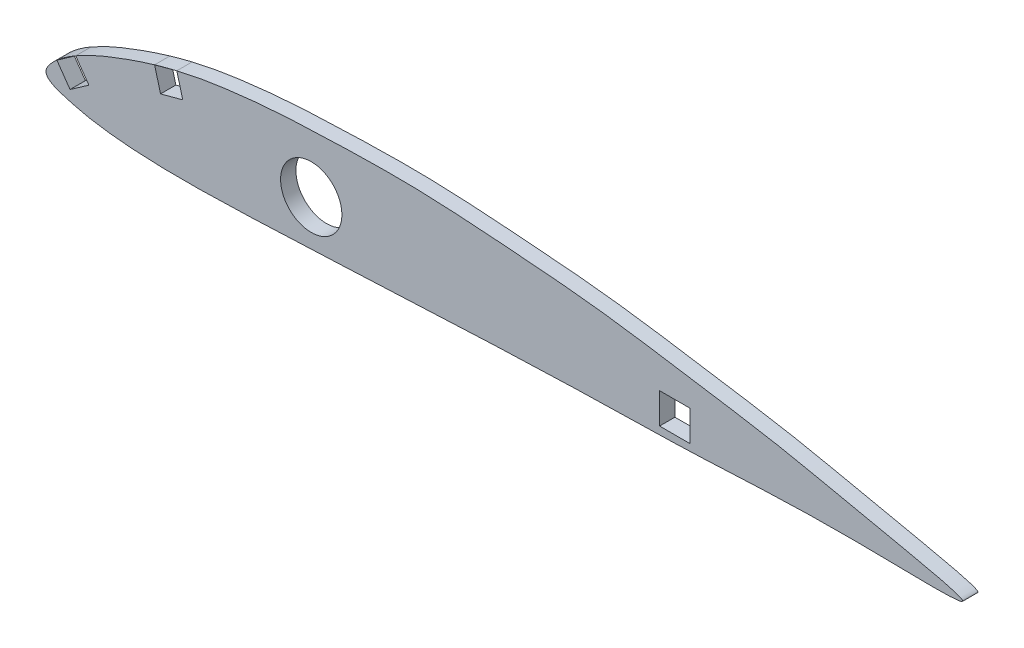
ISO-10303-21;
HEADER;
FILE_DESCRIPTION(('STEP AP214'),'2;1');
FILE_NAME('part.step','',(''),(''),'','','');
FILE_SCHEMA(('AUTOMOTIVE_DESIGN { 1 0 10303 214 1 1 1 1 }'));
ENDSEC;
DATA;
#1=APPLICATION_CONTEXT('core data for automotive mechanical design processes');
#2=APPLICATION_PROTOCOL_DEFINITION('international standard','automotive_design',2000,#1);
#3=PRODUCT_CONTEXT('',#1,'mechanical');
#4=PRODUCT('Part','Part','',(#3));
#5=PRODUCT_RELATED_PRODUCT_CATEGORY('part','',(#4));
#6=PRODUCT_DEFINITION_FORMATION('','',#4);
#7=PRODUCT_DEFINITION_CONTEXT('part definition',#1,'design');
#8=PRODUCT_DEFINITION('design','',#6,#7);
#9=PRODUCT_DEFINITION_SHAPE('','',#8);
#10=(LENGTH_UNIT() NAMED_UNIT(*) SI_UNIT(.MILLI.,.METRE.));
#11=(NAMED_UNIT(*) PLANE_ANGLE_UNIT() SI_UNIT($,.RADIAN.));
#12=(NAMED_UNIT(*) SI_UNIT($,.STERADIAN.) SOLID_ANGLE_UNIT());
#13=UNCERTAINTY_MEASURE_WITH_UNIT(LENGTH_MEASURE(1.E-05),#10,'distance_accuracy_value','');
#14=(GEOMETRIC_REPRESENTATION_CONTEXT(3) GLOBAL_UNCERTAINTY_ASSIGNED_CONTEXT((#13)) GLOBAL_UNIT_ASSIGNED_CONTEXT((#10,
#11,#12)) REPRESENTATION_CONTEXT('',''));
#15=CARTESIAN_POINT('',(0.,0.,0.));
#16=DIRECTION('',(0.,0.,1.));
#17=DIRECTION('',(1.,0.,0.));
#18=AXIS2_PLACEMENT_3D('',#15,#16,#17);
#19=CARTESIAN_POINT('',(0.,0.,0.));
#20=DIRECTION('',(0.,0.,-1.));
#21=DIRECTION('',(-1.,0.,0.));
#22=AXIS2_PLACEMENT_3D('',#19,#20,#21);
#23=PLANE('',#22);
#24=DIRECTION('',(0.,1.,0.));
#25=VECTOR('',#24,1.);
#26=CARTESIAN_POINT('',(127.097,0.,0.));
#27=LINE('',#26,#25);
#28=CARTESIAN_POINT('',(127.097,0.,0.));
#29=VERTEX_POINT('',#28);
#30=CARTESIAN_POINT('',(127.097,6.35,0.));
#31=VERTEX_POINT('',#30);
#32=EDGE_CURVE('E195',#29,#31,#27,.T.);
#33=ORIENTED_EDGE('',*,*,#32,.F.);
#34=DIRECTION('',(-1.,0.,0.));
#35=VECTOR('',#34,1.);
#36=CARTESIAN_POINT('',(0.,0.,0.));
#37=LINE('',#36,#35);
#38=CARTESIAN_POINT('',(133.447,0.,0.));
#39=VERTEX_POINT('',#38);
#40=EDGE_CURVE('E143',#39,#29,#37,.T.);
#41=ORIENTED_EDGE('',*,*,#40,.F.);
#42=DIRECTION('',(0.,-1.,0.));
#43=VECTOR('',#42,1.);
#44=CARTESIAN_POINT('',(133.447,0.,0.));
#45=LINE('',#44,#43);
#46=CARTESIAN_POINT('',(133.447,6.35,0.));
#47=VERTEX_POINT('',#46);
#48=EDGE_CURVE('E131',#47,#39,#45,.T.);
#49=ORIENTED_EDGE('',*,*,#48,.F.);
#50=DIRECTION('',(1.,0.,0.));
#51=VECTOR('',#50,1.);
#52=CARTESIAN_POINT('',(0.,6.35,0.));
#53=LINE('',#52,#51);
#54=EDGE_CURVE('E151',#31,#47,#53,.T.);
#55=ORIENTED_EDGE('',*,*,#54,.F.);
#56=EDGE_LOOP('',(#33,#41,#49,#55));
#57=FACE_BOUND('',#56,.T.);
#58=DIRECTION('',(-0.573576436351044,0.819152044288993,0.));
#59=VECTOR('',#58,1.);
#60=CARTESIAN_POINT('',(3.0212446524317,2.11549828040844,0.));
#61=LINE('',#60,#59);
#62=CARTESIAN_POINT('',(4.98235798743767,-0.685261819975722,0.));
#63=VERTEX_POINT('',#62);
#64=CARTESIAN_POINT('',(2.25070020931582,3.21594979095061,0.));
#65=VERTEX_POINT('',#64);
#66=EDGE_CURVE('E157',#63,#65,#61,.T.);
#67=ORIENTED_EDGE('',*,*,#66,.F.);
#68=DIRECTION('',(-0.819152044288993,-0.573576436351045,0.));
#69=VECTOR('',#68,1.);
#70=CARTESIAN_POINT('',(1.96111333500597,-2.80076010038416,0.));
#71=LINE('',#70,#69);
#72=CARTESIAN_POINT('',(8.883569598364,2.04639595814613,0.));
#73=VERTEX_POINT('',#72);
#74=EDGE_CURVE('E214',#73,#63,#71,.T.);
#75=ORIENTED_EDGE('',*,*,#74,.F.);
#76=DIRECTION('',(0.573576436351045,-0.819152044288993,0.));
#77=VECTOR('',#76,1.);
#78=CARTESIAN_POINT('',(6.92245626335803,4.8471560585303,0.));
#79=LINE('',#78,#77);
#80=CARTESIAN_POINT('',(6.15191182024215,5.94760756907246,0.));
#81=VERTEX_POINT('',#80);
#82=EDGE_CURVE('E224',#81,#73,#79,.T.);
#83=ORIENTED_EDGE('',*,*,#82,.F.);
#84=CARTESIAN_POINT('',(0.,0.,0.));
#85=CARTESIAN_POINT('',(-0.052312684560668,1.01588552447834,0.));
#86=CARTESIAN_POINT('',(2.16598697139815,3.29635815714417,0.));
#87=CARTESIAN_POINT('',(5.31665733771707,5.55289262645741,0.));
#88=CARTESIAN_POINT('',(9.40016071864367,7.75182181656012,0.));
#89=CARTESIAN_POINT('',(17.2202194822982,10.9327993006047,0.));
#90=CARTESIAN_POINT('',(26.7064135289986,13.9594122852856,0.));
#91=CARTESIAN_POINT('',(37.9353835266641,15.7551230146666,0.));
#92=CARTESIAN_POINT('',(47.452587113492,16.7049080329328,0.));
#93=CARTESIAN_POINT('',(60.1209164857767,17.2358385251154,0.));
#94=CARTESIAN_POINT('',(75.972266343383,17.6854280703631,0.));
#95=CARTESIAN_POINT('',(94.9440869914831,16.3539049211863,0.));
#96=CARTESIAN_POINT('',(114.052882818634,14.8649493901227,0.));
#97=CARTESIAN_POINT('',(132.728084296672,11.8733247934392,0.));
#98=CARTESIAN_POINT('',(152.761524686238,8.81070256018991,0.));
#99=CARTESIAN_POINT('',(168.050310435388,5.21393768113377,0.));
#100=CARTESIAN_POINT('',(200.59520382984,-1.23261563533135,0.));
#101=CARTESIAN_POINT('',(158.485441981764,0.250590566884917,0.));
#102=CARTESIAN_POINT('',(140.172902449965,-1.42529799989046,0.));
#103=CARTESIAN_POINT('',(100.64106675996,-2.04847327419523,0.));
#104=CARTESIAN_POINT('',(69.7391640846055,-3.73228321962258,0.));
#105=CARTESIAN_POINT('',(37.922908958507,-5.11912377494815,0.));
#106=CARTESIAN_POINT('',(22.2869194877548,-5.37550998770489,0.));
#107=CARTESIAN_POINT('',(10.7780722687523,-4.26084328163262,0.));
#108=CARTESIAN_POINT('',(4.91909071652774,-2.92119132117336,0.));
#109=CARTESIAN_POINT('',(0.0717865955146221,-1.39405889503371,0.));
#110=CARTESIAN_POINT('',(0.,0.,0.));
#111=B_SPLINE_CURVE_WITH_KNOTS('',3,(#84,#85,#86,#87,#88,#89,#90,#91,#92,#93,#94,#95,#96,#97,
#98,#99,#100,#101,#102,#103,#104,#105,#106,#107,#108,#109,#110),.UNSPECIFIED.,.T.,.F.,(4,1,1,1,
1,1,1,1,1,1,1,1,1,1,1,1,1,1,1,1,1,1,1,1,4),(0.,0.0105604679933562,0.0182111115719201,
0.0322098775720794,0.0455249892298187,0.0840694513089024,0.10897429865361,0.133649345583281,
0.158232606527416,0.207343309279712,0.25652270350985,0.30582635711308,0.355445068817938,
0.40521420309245,0.4553904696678,0.506006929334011,0.555121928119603,0.653369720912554,
0.702490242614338,0.849938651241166,0.899083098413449,0.948194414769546,0.972905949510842,
0.985508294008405,1.),.UNSPECIFIED.);
#112=CARTESIAN_POINT('',(22.4932353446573,12.498714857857,0.));
#113=VERTEX_POINT('',#112);
#114=EDGE_CURVE('E170',#81,#113,#111,.T.);
#115=ORIENTED_EDGE('',*,*,#114,.T.);
#116=DIRECTION('',(-0.258819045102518,0.965925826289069,0.));
#117=VECTOR('',#116,1.);
#118=CARTESIAN_POINT('',(24.1111529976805,6.46056397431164,0.));
#119=LINE('',#118,#117);
#120=CARTESIAN_POINT('',(23.725861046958,7.89849311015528,0.));
#121=VERTEX_POINT('',#120);
#122=EDGE_CURVE('E206',#121,#113,#119,.T.);
#123=ORIENTED_EDGE('',*,*,#122,.F.);
#124=DIRECTION('',(-0.965925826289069,-0.258819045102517,0.));
#125=VECTOR('',#124,1.);
#126=CARTESIAN_POINT('',(-0.385291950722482,1.43792913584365,0.));
#127=LINE('',#126,#125);
#128=CARTESIAN_POINT('',(28.3260827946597,9.13111881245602,0.));
#129=VERTEX_POINT('',#128);
#130=EDGE_CURVE('E218',#129,#121,#127,.T.);
#131=ORIENTED_EDGE('',*,*,#130,.F.);
#132=DIRECTION('',(0.258819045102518,-0.965925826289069,0.));
#133=VECTOR('',#132,1.);
#134=CARTESIAN_POINT('',(28.7113747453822,7.6931896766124,0.));
#135=LINE('',#134,#133);
#136=CARTESIAN_POINT('',(27.093457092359,13.7313405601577,0.));
#137=VERTEX_POINT('',#136);
#138=EDGE_CURVE('E228',#137,#129,#135,.T.);
#139=ORIENTED_EDGE('',*,*,#138,.F.);
#140=EDGE_CURVE('E163',#137,#65,#111,.T.);
#141=ORIENTED_EDGE('',*,*,#140,.T.);
#142=EDGE_LOOP('',(#67,#75,#83,#115,#123,#131,#139,#141));
#143=FACE_BOUND('',#142,.T.);
#144=CARTESIAN_POINT('',(54.94,5.,0.));
#145=DIRECTION('',(0.,0.,-1.));
#146=DIRECTION('',(-1.,0.,0.));
#147=AXIS2_PLACEMENT_3D('',#144,#145,#146);
#148=CIRCLE('',#147,6.35);
#149=CARTESIAN_POINT('',(48.59,5.,0.));
#150=VERTEX_POINT('',#149);
#151=EDGE_CURVE('E201',#150,#150,#148,.T.);
#152=ORIENTED_EDGE('',*,*,#151,.F.);
#153=EDGE_LOOP('',(#152));
#154=FACE_BOUND('',#153,.T.);
#155=ADVANCED_FACE('F44',(#57,#143,#154),#23,.T.);
#156=CARTESIAN_POINT('',(0.,0.,3.175));
#157=DIRECTION('',(0.,0.,-1.));
#158=DIRECTION('',(-1.,0.,0.));
#159=AXIS2_PLACEMENT_3D('',#156,#157,#158);
#160=PLANE('',#159);
#161=DIRECTION('',(1.,0.,0.));
#162=VECTOR('',#161,1.);
#163=CARTESIAN_POINT('',(127.097,0.,3.175));
#164=LINE('',#163,#162);
#165=CARTESIAN_POINT('',(127.097,0.,3.175));
#166=VERTEX_POINT('',#165);
#167=CARTESIAN_POINT('',(133.447,0.,3.175));
#168=VERTEX_POINT('',#167);
#169=EDGE_CURVE('E13',#166,#168,#164,.T.);
#170=ORIENTED_EDGE('',*,*,#169,.F.);
#171=DIRECTION('',(0.,-1.,0.));
#172=VECTOR('',#171,1.);
#173=CARTESIAN_POINT('',(127.097,6.35,3.175));
#174=LINE('',#173,#172);
#175=CARTESIAN_POINT('',(127.097,6.35,3.175));
#176=VERTEX_POINT('',#175);
#177=EDGE_CURVE('E149',#176,#166,#174,.T.);
#178=ORIENTED_EDGE('',*,*,#177,.F.);
#179=DIRECTION('',(-1.,0.,0.));
#180=VECTOR('',#179,1.);
#181=CARTESIAN_POINT('',(127.097,6.35,3.175));
#182=LINE('',#181,#180);
#183=CARTESIAN_POINT('',(133.447,6.35,3.175));
#184=VERTEX_POINT('',#183);
#185=EDGE_CURVE('E142',#184,#176,#182,.T.);
#186=ORIENTED_EDGE('',*,*,#185,.F.);
#187=DIRECTION('',(0.,1.,0.));
#188=VECTOR('',#187,1.);
#189=CARTESIAN_POINT('',(133.447,6.35,3.175));
#190=LINE('',#189,#188);
#191=EDGE_CURVE('E128',#168,#184,#190,.T.);
#192=ORIENTED_EDGE('',*,*,#191,.F.);
#193=EDGE_LOOP('',(#170,#178,#186,#192));
#194=FACE_BOUND('',#193,.T.);
#195=CARTESIAN_POINT('',(54.94,5.,3.175));
#196=DIRECTION('',(0.,0.,1.));
#197=DIRECTION('',(1.,0.,0.));
#198=AXIS2_PLACEMENT_3D('',#195,#196,#197);
#199=CIRCLE('',#198,6.35);
#200=CARTESIAN_POINT('',(61.29,5.,3.175));
#201=VERTEX_POINT('',#200);
#202=EDGE_CURVE('E203',#201,#201,#199,.T.);
#203=ORIENTED_EDGE('',*,*,#202,.F.);
#204=EDGE_LOOP('',(#203));
#205=FACE_BOUND('',#204,.T.);
#206=DIRECTION('',(0.819152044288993,0.573576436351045,0.));
#207=VECTOR('',#206,1.);
#208=CARTESIAN_POINT('',(4.98235798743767,-0.685261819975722,3.175));
#209=LINE('',#208,#207);
#210=CARTESIAN_POINT('',(4.98235798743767,-0.685261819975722,3.175));
#211=VERTEX_POINT('',#210);
#212=CARTESIAN_POINT('',(8.883569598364,2.04639595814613,3.175));
#213=VERTEX_POINT('',#212);
#214=EDGE_CURVE('E211',#211,#213,#209,.T.);
#215=ORIENTED_EDGE('',*,*,#214,.F.);
#216=DIRECTION('',(0.573576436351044,-0.819152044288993,0.));
#217=VECTOR('',#216,1.);
#218=CARTESIAN_POINT('',(2.25070020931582,3.21594979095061,3.175));
#219=LINE('',#218,#217);
#220=CARTESIAN_POINT('',(2.25070020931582,3.21594979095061,3.175));
#221=VERTEX_POINT('',#220);
#222=EDGE_CURVE('E156',#221,#211,#219,.T.);
#223=ORIENTED_EDGE('',*,*,#222,.F.);
#224=CARTESIAN_POINT('',(0.,0.,3.175));
#225=CARTESIAN_POINT('',(-0.052312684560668,1.01588552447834,3.175));
#226=CARTESIAN_POINT('',(2.16598697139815,3.29635815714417,3.175));
#227=CARTESIAN_POINT('',(5.31665733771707,5.55289262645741,3.175));
#228=CARTESIAN_POINT('',(9.40016071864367,7.75182181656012,3.175));
#229=CARTESIAN_POINT('',(17.2202194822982,10.9327993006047,3.175));
#230=CARTESIAN_POINT('',(26.7064135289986,13.9594122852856,3.175));
#231=CARTESIAN_POINT('',(37.9353835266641,15.7551230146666,3.175));
#232=CARTESIAN_POINT('',(47.452587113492,16.7049080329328,3.175));
#233=CARTESIAN_POINT('',(60.1209164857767,17.2358385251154,3.175));
#234=CARTESIAN_POINT('',(75.972266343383,17.6854280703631,3.175));
#235=CARTESIAN_POINT('',(94.9440869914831,16.3539049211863,3.175));
#236=CARTESIAN_POINT('',(114.052882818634,14.8649493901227,3.175));
#237=CARTESIAN_POINT('',(132.728084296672,11.8733247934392,3.175));
#238=CARTESIAN_POINT('',(152.761524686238,8.81070256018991,3.175));
#239=CARTESIAN_POINT('',(168.050310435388,5.21393768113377,3.175));
#240=CARTESIAN_POINT('',(200.59520382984,-1.23261563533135,3.175));
#241=CARTESIAN_POINT('',(158.485441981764,0.250590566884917,3.175));
#242=CARTESIAN_POINT('',(140.172902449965,-1.42529799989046,3.175));
#243=CARTESIAN_POINT('',(100.64106675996,-2.04847327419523,3.175));
#244=CARTESIAN_POINT('',(69.7391640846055,-3.73228321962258,3.175));
#245=CARTESIAN_POINT('',(37.922908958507,-5.11912377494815,3.175));
#246=CARTESIAN_POINT('',(22.2869194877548,-5.37550998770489,3.175));
#247=CARTESIAN_POINT('',(10.7780722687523,-4.26084328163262,3.175));
#248=CARTESIAN_POINT('',(4.91909071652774,-2.92119132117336,3.175));
#249=CARTESIAN_POINT('',(0.0717865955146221,-1.39405889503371,3.175));
#250=CARTESIAN_POINT('',(0.,0.,3.175));
#251=B_SPLINE_CURVE_WITH_KNOTS('',3,(#224,#225,#226,#227,#228,#229,#230,#231,#232,#233,#234,
#235,#236,#237,#238,#239,#240,#241,#242,#243,#244,#245,#246,#247,#248,#249,#250),.UNSPECIFIED.,
.T.,.F.,(4,1,1,1,1,1,1,1,1,1,1,1,1,1,1,1,1,1,1,1,1,1,1,1,4),(0.,0.0105604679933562,
0.0182111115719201,0.0322098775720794,0.0455249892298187,0.0840694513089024,0.10897429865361,
0.133649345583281,0.158232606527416,0.207343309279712,0.25652270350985,0.30582635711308,
0.355445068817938,0.40521420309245,0.4553904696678,0.506006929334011,0.555121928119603,
0.653369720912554,0.702490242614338,0.849938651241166,0.899083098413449,0.948194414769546,
0.972905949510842,0.985508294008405,1.),.UNSPECIFIED.);
#252=CARTESIAN_POINT('',(27.0934570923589,13.7313405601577,3.175));
#253=VERTEX_POINT('',#252);
#254=EDGE_CURVE('E162',#253,#221,#251,.T.);
#255=ORIENTED_EDGE('',*,*,#254,.F.);
#256=DIRECTION('',(-0.258819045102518,0.965925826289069,0.));
#257=VECTOR('',#256,1.);
#258=CARTESIAN_POINT('',(27.093457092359,13.7313405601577,3.175));
#259=LINE('',#258,#257);
#260=CARTESIAN_POINT('',(28.3260827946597,9.13111881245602,3.175));
#261=VERTEX_POINT('',#260);
#262=EDGE_CURVE('E221',#261,#253,#259,.T.);
#263=ORIENTED_EDGE('',*,*,#262,.F.);
#264=DIRECTION('',(0.965925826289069,0.258819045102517,0.));
#265=VECTOR('',#264,1.);
#266=CARTESIAN_POINT('',(23.725861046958,7.89849311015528,3.175));
#267=LINE('',#266,#265);
#268=CARTESIAN_POINT('',(23.725861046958,7.89849311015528,3.175));
#269=VERTEX_POINT('',#268);
#270=EDGE_CURVE('E223',#269,#261,#267,.T.);
#271=ORIENTED_EDGE('',*,*,#270,.F.);
#272=DIRECTION('',(0.258819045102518,-0.965925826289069,0.));
#273=VECTOR('',#272,1.);
#274=CARTESIAN_POINT('',(22.4932353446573,12.498714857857,3.175));
#275=LINE('',#274,#273);
#276=CARTESIAN_POINT('',(22.4932353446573,12.498714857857,3.175));
#277=VERTEX_POINT('',#276);
#278=EDGE_CURVE('E231',#277,#269,#275,.T.);
#279=ORIENTED_EDGE('',*,*,#278,.F.);
#280=CARTESIAN_POINT('',(6.15191183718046,5.94760757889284,3.175));
#281=VERTEX_POINT('',#280);
#282=EDGE_CURVE('E161',#281,#277,#251,.T.);
#283=ORIENTED_EDGE('',*,*,#282,.F.);
#284=DIRECTION('',(-0.573576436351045,0.819152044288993,0.));
#285=VECTOR('',#284,1.);
#286=CARTESIAN_POINT('',(6.15191182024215,5.94760756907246,3.175));
#287=LINE('',#286,#285);
#288=EDGE_CURVE('E217',#213,#281,#287,.T.);
#289=ORIENTED_EDGE('',*,*,#288,.F.);
#290=EDGE_LOOP('',(#215,#223,#255,#263,#271,#279,#283,#289));
#291=FACE_BOUND('',#290,.T.);
#292=ADVANCED_FACE('F140',(#194,#205,#291),#160,.F.);
#293=DIRECTION('',(0.,0.,1.));
#294=VECTOR('',#293,1.);
#295=SURFACE_OF_LINEAR_EXTRUSION('',#111,#294);
#296=DIRECTION('',(0.,0.,1.));
#297=VECTOR('',#296,1.);
#298=CARTESIAN_POINT('',(2.25070020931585,3.21594979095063,0.));
#299=LINE('',#298,#297);
#300=EDGE_CURVE('E153',#65,#221,#299,.T.);
#301=ORIENTED_EDGE('',*,*,#300,.F.);
#302=ORIENTED_EDGE('',*,*,#140,.F.);
#303=DIRECTION('',(0.,0.,1.));
#304=VECTOR('',#303,1.);
#305=CARTESIAN_POINT('',(27.093457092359,13.7313405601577,0.));
#306=LINE('',#305,#304);
#307=EDGE_CURVE('E169',#137,#253,#306,.T.);
#308=ORIENTED_EDGE('',*,*,#307,.T.);
#309=ORIENTED_EDGE('',*,*,#254,.T.);
#310=EDGE_LOOP('',(#301,#302,#308,#309));
#311=FACE_BOUND('',#310,.T.);
#312=ADVANCED_FACE('F179',(#311),#295,.F.);
#313=ORIENTED_EDGE('',*,*,#114,.F.);
#314=DIRECTION('',(0.,0.,1.));
#315=VECTOR('',#314,1.);
#316=CARTESIAN_POINT('',(6.15191182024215,5.94760756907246,0.));
#317=LINE('',#316,#315);
#318=EDGE_CURVE('E158',#81,#281,#317,.T.);
#319=ORIENTED_EDGE('',*,*,#318,.T.);
#320=ORIENTED_EDGE('',*,*,#282,.T.);
#321=DIRECTION('',(0.,0.,1.));
#322=VECTOR('',#321,1.);
#323=CARTESIAN_POINT('',(22.4932353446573,12.498714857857,0.));
#324=LINE('',#323,#322);
#325=EDGE_CURVE('E47',#113,#277,#324,.T.);
#326=ORIENTED_EDGE('',*,*,#325,.F.);
#327=EDGE_LOOP('',(#313,#319,#320,#326));
#328=FACE_BOUND('',#327,.T.);
#329=ADVANCED_FACE('F175',(#328),#295,.F.);
#330=CARTESIAN_POINT('',(54.94,5.,-6.825));
#331=DIRECTION('',(0.,0.,1.));
#332=DIRECTION('',(1.,0.,0.));
#333=AXIS2_PLACEMENT_3D('',#330,#331,#332);
#334=CYLINDRICAL_SURFACE('',#333,6.35);
#335=ORIENTED_EDGE('',*,*,#151,.T.);
#336=EDGE_LOOP('',(#335));
#337=FACE_BOUND('',#336,.T.);
#338=ORIENTED_EDGE('',*,*,#202,.T.);
#339=EDGE_LOOP('',(#338));
#340=FACE_BOUND('',#339,.T.);
#341=ADVANCED_FACE('F178',(#337,#340),#334,.F.);
#342=CARTESIAN_POINT('',(22.4932353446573,12.498714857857,-6.825));
#343=DIRECTION('',(-0.965925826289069,-0.258819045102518,0.));
#344=DIRECTION('',(0.258819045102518,-0.965925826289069,0.));
#345=AXIS2_PLACEMENT_3D('',#342,#343,#344);
#346=PLANE('',#345);
#347=ORIENTED_EDGE('',*,*,#122,.T.);
#348=ORIENTED_EDGE('',*,*,#325,.T.);
#349=ORIENTED_EDGE('',*,*,#278,.T.);
#350=DIRECTION('',(0.,0.,1.));
#351=VECTOR('',#350,1.);
#352=CARTESIAN_POINT('',(23.725861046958,7.89849311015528,-6.825));
#353=LINE('',#352,#351);
#354=EDGE_CURVE('E220',#121,#269,#353,.T.);
#355=ORIENTED_EDGE('',*,*,#354,.F.);
#356=EDGE_LOOP('',(#347,#348,#349,#355));
#357=FACE_BOUND('',#356,.T.);
#358=ADVANCED_FACE('F324',(#357),#346,.F.);
#359=CARTESIAN_POINT('',(27.093457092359,13.7313405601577,-6.825));
#360=DIRECTION('',(0.965925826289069,0.258819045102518,0.));
#361=DIRECTION('',(-0.258819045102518,0.965925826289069,0.));
#362=AXIS2_PLACEMENT_3D('',#359,#360,#361);
#363=PLANE('',#362);
#364=ORIENTED_EDGE('',*,*,#138,.T.);
#365=DIRECTION('',(0.,0.,1.));
#366=VECTOR('',#365,1.);
#367=CARTESIAN_POINT('',(28.3260827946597,9.13111881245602,-6.825));
#368=LINE('',#367,#366);
#369=EDGE_CURVE('E230',#129,#261,#368,.T.);
#370=ORIENTED_EDGE('',*,*,#369,.T.);
#371=ORIENTED_EDGE('',*,*,#262,.T.);
#372=ORIENTED_EDGE('',*,*,#307,.F.);
#373=EDGE_LOOP('',(#364,#370,#371,#372));
#374=FACE_BOUND('',#373,.T.);
#375=ADVANCED_FACE('F314',(#374),#363,.F.);
#376=CARTESIAN_POINT('',(23.725861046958,7.89849311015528,-6.825));
#377=DIRECTION('',(0.258819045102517,-0.965925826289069,0.));
#378=DIRECTION('',(0.965925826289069,0.258819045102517,0.));
#379=AXIS2_PLACEMENT_3D('',#376,#377,#378);
#380=PLANE('',#379);
#381=ORIENTED_EDGE('',*,*,#130,.T.);
#382=ORIENTED_EDGE('',*,*,#354,.T.);
#383=ORIENTED_EDGE('',*,*,#270,.T.);
#384=ORIENTED_EDGE('',*,*,#369,.F.);
#385=EDGE_LOOP('',(#381,#382,#383,#384));
#386=FACE_BOUND('',#385,.T.);
#387=ADVANCED_FACE('F304',(#386),#380,.F.);
#388=CARTESIAN_POINT('',(2.25070020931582,3.21594979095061,-6.825));
#389=DIRECTION('',(-0.819152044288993,-0.573576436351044,0.));
#390=DIRECTION('',(0.573576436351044,-0.819152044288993,0.));
#391=AXIS2_PLACEMENT_3D('',#388,#389,#390);
#392=PLANE('',#391);
#393=ORIENTED_EDGE('',*,*,#66,.T.);
#394=ORIENTED_EDGE('',*,*,#300,.T.);
#395=ORIENTED_EDGE('',*,*,#222,.T.);
#396=DIRECTION('',(0.,0.,1.));
#397=VECTOR('',#396,1.);
#398=CARTESIAN_POINT('',(4.98235798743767,-0.685261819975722,-6.825));
#399=LINE('',#398,#397);
#400=EDGE_CURVE('E216',#63,#211,#399,.T.);
#401=ORIENTED_EDGE('',*,*,#400,.F.);
#402=EDGE_LOOP('',(#393,#394,#395,#401));
#403=FACE_BOUND('',#402,.T.);
#404=ADVANCED_FACE('F295',(#403),#392,.F.);
#405=CARTESIAN_POINT('',(6.15191182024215,5.94760756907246,-6.825));
#406=DIRECTION('',(0.819152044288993,0.573576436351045,0.));
#407=DIRECTION('',(-0.573576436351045,0.819152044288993,0.));
#408=AXIS2_PLACEMENT_3D('',#405,#406,#407);
#409=PLANE('',#408);
#410=ORIENTED_EDGE('',*,*,#82,.T.);
#411=DIRECTION('',(0.,0.,1.));
#412=VECTOR('',#411,1.);
#413=CARTESIAN_POINT('',(8.883569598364,2.04639595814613,-6.825));
#414=LINE('',#413,#412);
#415=EDGE_CURVE('E226',#73,#213,#414,.T.);
#416=ORIENTED_EDGE('',*,*,#415,.T.);
#417=ORIENTED_EDGE('',*,*,#288,.T.);
#418=ORIENTED_EDGE('',*,*,#318,.F.);
#419=EDGE_LOOP('',(#410,#416,#417,#418));
#420=FACE_BOUND('',#419,.T.);
#421=ADVANCED_FACE('F260',(#420),#409,.F.);
#422=CARTESIAN_POINT('',(4.98235798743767,-0.685261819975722,-6.825));
#423=DIRECTION('',(0.573576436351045,-0.819152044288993,0.));
#424=DIRECTION('',(0.819152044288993,0.573576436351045,0.));
#425=AXIS2_PLACEMENT_3D('',#422,#423,#424);
#426=PLANE('',#425);
#427=ORIENTED_EDGE('',*,*,#74,.T.);
#428=ORIENTED_EDGE('',*,*,#400,.T.);
#429=ORIENTED_EDGE('',*,*,#214,.T.);
#430=ORIENTED_EDGE('',*,*,#415,.F.);
#431=EDGE_LOOP('',(#427,#428,#429,#430));
#432=FACE_BOUND('',#431,.T.);
#433=ADVANCED_FACE('F255',(#432),#426,.F.);
#434=CARTESIAN_POINT('',(127.097,6.35,-6.825));
#435=DIRECTION('',(-1.,0.,0.));
#436=DIRECTION('',(0.,0.,1.));
#437=AXIS2_PLACEMENT_3D('',#434,#435,#436);
#438=PLANE('',#437);
#439=ORIENTED_EDGE('',*,*,#32,.T.);
#440=DIRECTION('',(0.,0.,1.));
#441=VECTOR('',#440,1.);
#442=CARTESIAN_POINT('',(127.097,6.35,-6.825));
#443=LINE('',#442,#441);
#444=EDGE_CURVE('E152',#31,#176,#443,.T.);
#445=ORIENTED_EDGE('',*,*,#444,.T.);
#446=ORIENTED_EDGE('',*,*,#177,.T.);
#447=DIRECTION('',(0.,0.,1.));
#448=VECTOR('',#447,1.);
#449=CARTESIAN_POINT('',(127.097,0.,-6.825));
#450=LINE('',#449,#448);
#451=EDGE_CURVE('E53',#29,#166,#450,.T.);
#452=ORIENTED_EDGE('',*,*,#451,.F.);
#453=EDGE_LOOP('',(#439,#445,#446,#452));
#454=FACE_BOUND('',#453,.T.);
#455=ADVANCED_FACE('F249',(#454),#438,.F.);
#456=CARTESIAN_POINT('',(127.097,6.35,-6.825));
#457=DIRECTION('',(0.,1.,0.));
#458=DIRECTION('',(0.,0.,1.));
#459=AXIS2_PLACEMENT_3D('',#456,#457,#458);
#460=PLANE('',#459);
#461=ORIENTED_EDGE('',*,*,#54,.T.);
#462=DIRECTION('',(0.,0.,1.));
#463=VECTOR('',#462,1.);
#464=CARTESIAN_POINT('',(133.447,6.35,-6.825));
#465=LINE('',#464,#463);
#466=EDGE_CURVE('E123',#47,#184,#465,.T.);
#467=ORIENTED_EDGE('',*,*,#466,.T.);
#468=ORIENTED_EDGE('',*,*,#185,.T.);
#469=ORIENTED_EDGE('',*,*,#444,.F.);
#470=EDGE_LOOP('',(#461,#467,#468,#469));
#471=FACE_BOUND('',#470,.T.);
#472=ADVANCED_FACE('F181',(#471),#460,.F.);
#473=CARTESIAN_POINT('',(133.447,6.35,-6.825));
#474=DIRECTION('',(1.,0.,0.));
#475=DIRECTION('',(0.,0.,-1.));
#476=AXIS2_PLACEMENT_3D('',#473,#474,#475);
#477=PLANE('',#476);
#478=ORIENTED_EDGE('',*,*,#48,.T.);
#479=DIRECTION('',(0.,0.,1.));
#480=VECTOR('',#479,1.);
#481=CARTESIAN_POINT('',(133.447,0.,-6.825));
#482=LINE('',#481,#480);
#483=EDGE_CURVE('E61',#39,#168,#482,.T.);
#484=ORIENTED_EDGE('',*,*,#483,.T.);
#485=ORIENTED_EDGE('',*,*,#191,.T.);
#486=ORIENTED_EDGE('',*,*,#466,.F.);
#487=EDGE_LOOP('',(#478,#484,#485,#486));
#488=FACE_BOUND('',#487,.T.);
#489=ADVANCED_FACE('F126',(#488),#477,.F.);
#490=CARTESIAN_POINT('',(127.097,0.,-6.825));
#491=DIRECTION('',(0.,-1.,0.));
#492=DIRECTION('',(0.,0.,-1.));
#493=AXIS2_PLACEMENT_3D('',#490,#491,#492);
#494=PLANE('',#493);
#495=ORIENTED_EDGE('',*,*,#40,.T.);
#496=ORIENTED_EDGE('',*,*,#451,.T.);
#497=ORIENTED_EDGE('',*,*,#169,.T.);
#498=ORIENTED_EDGE('',*,*,#483,.F.);
#499=EDGE_LOOP('',(#495,#496,#497,#498));
#500=FACE_BOUND('',#499,.T.);
#501=ADVANCED_FACE('F136',(#500),#494,.F.);
#502=CLOSED_SHELL('',(#155,#292,#312,#329,#341,#358,#375,#387,#404,#421,#433,#455,#472,#489,#501));
#503=MANIFOLD_SOLID_BREP('B2',#502);
#504=CARTESIAN_POINT('',(0.,0.,0.));
#505=CARTESIAN_POINT('',(-0.052312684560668,1.01588552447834,0.));
#506=CARTESIAN_POINT('',(2.16598697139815,3.29635815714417,0.));
#507=CARTESIAN_POINT('',(5.31665733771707,5.55289262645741,0.));
#508=CARTESIAN_POINT('',(9.40016071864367,7.75182181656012,0.));
#509=CARTESIAN_POINT('',(17.2202194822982,10.9327993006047,0.));
#510=CARTESIAN_POINT('',(26.7064135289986,13.9594122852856,0.));
#511=CARTESIAN_POINT('',(37.9353835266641,15.7551230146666,0.));
#512=CARTESIAN_POINT('',(47.452587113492,16.7049080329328,0.));
#513=CARTESIAN_POINT('',(60.1209164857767,17.2358385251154,0.));
#514=CARTESIAN_POINT('',(75.972266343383,17.6854280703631,0.));
#515=CARTESIAN_POINT('',(94.9440869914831,16.3539049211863,0.));
#516=CARTESIAN_POINT('',(114.052882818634,14.8649493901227,0.));
#517=CARTESIAN_POINT('',(132.728084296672,11.8733247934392,0.));
#518=CARTESIAN_POINT('',(152.761524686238,8.81070256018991,0.));
#519=CARTESIAN_POINT('',(168.050310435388,5.21393768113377,0.));
#520=CARTESIAN_POINT('',(200.59520382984,-1.23261563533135,0.));
#521=CARTESIAN_POINT('',(158.485441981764,0.250590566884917,0.));
#522=CARTESIAN_POINT('',(140.172902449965,-1.42529799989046,0.));
#523=CARTESIAN_POINT('',(100.64106675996,-2.04847327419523,0.));
#524=CARTESIAN_POINT('',(69.7391640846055,-3.73228321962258,0.));
#525=CARTESIAN_POINT('',(37.922908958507,-5.11912377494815,0.));
#526=CARTESIAN_POINT('',(22.2869194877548,-5.37550998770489,0.));
#527=CARTESIAN_POINT('',(10.7780722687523,-4.26084328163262,0.));
#528=CARTESIAN_POINT('',(4.91909071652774,-2.92119132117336,0.));
#529=CARTESIAN_POINT('',(0.0717865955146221,-1.39405889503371,0.));
#530=CARTESIAN_POINT('',(0.,0.,0.));
#531=B_SPLINE_CURVE_WITH_KNOTS('',3,(#504,#505,#506,#507,#508,#509,#510,#511,#512,#513,#514,
#515,#516,#517,#518,#519,#520,#521,#522,#523,#524,#525,#526,#527,#528,#529,#530),.UNSPECIFIED.,
.T.,.F.,(4,1,1,1,1,1,1,1,1,1,1,1,1,1,1,1,1,1,1,1,1,1,1,1,4),(0.,0.0105604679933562,
0.0182111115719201,0.0322098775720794,0.0455249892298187,0.0840694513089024,0.10897429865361,
0.133649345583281,0.158232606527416,0.207343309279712,0.25652270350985,0.30582635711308,
0.355445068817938,0.40521420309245,0.4553904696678,0.506006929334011,0.555121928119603,
0.653369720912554,0.702490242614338,0.849938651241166,0.899083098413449,0.948194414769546,
0.972905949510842,0.985508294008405,1.),.UNSPECIFIED.);
#532=DIRECTION('',(0.,0.,1.));
#533=VECTOR('',#532,1.);
#534=SURFACE_OF_LINEAR_EXTRUSION('',#531,#533);
#535=CARTESIAN_POINT('',(22.4932353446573,12.498714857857,0.));
#536=VERTEX_POINT('',#535);
#537=CARTESIAN_POINT('',(27.093457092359,13.7313405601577,0.));
#538=VERTEX_POINT('',#537);
#539=EDGE_CURVE('E447',#536,#538,#531,.T.);
#540=ORIENTED_EDGE('',*,*,#539,.F.);
#541=DIRECTION('',(0.,0.,1.));
#542=VECTOR('',#541,1.);
#543=CARTESIAN_POINT('',(22.4932353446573,12.498714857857,0.));
#544=LINE('',#543,#542);
#545=CARTESIAN_POINT('',(22.4932353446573,12.498714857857,3.175));
#546=VERTEX_POINT('',#545);
#547=EDGE_CURVE('E434',#536,#546,#544,.T.);
#548=ORIENTED_EDGE('',*,*,#547,.T.);
#549=CARTESIAN_POINT('',(0.,0.,3.175));
#550=CARTESIAN_POINT('',(-0.052312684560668,1.01588552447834,3.175));
#551=CARTESIAN_POINT('',(2.16598697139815,3.29635815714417,3.175));
#552=CARTESIAN_POINT('',(5.31665733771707,5.55289262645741,3.175));
#553=CARTESIAN_POINT('',(9.40016071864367,7.75182181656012,3.175));
#554=CARTESIAN_POINT('',(17.2202194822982,10.9327993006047,3.175));
#555=CARTESIAN_POINT('',(26.7064135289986,13.9594122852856,3.175));
#556=CARTESIAN_POINT('',(37.9353835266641,15.7551230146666,3.175));
#557=CARTESIAN_POINT('',(47.452587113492,16.7049080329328,3.175));
#558=CARTESIAN_POINT('',(60.1209164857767,17.2358385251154,3.175));
#559=CARTESIAN_POINT('',(75.972266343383,17.6854280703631,3.175));
#560=CARTESIAN_POINT('',(94.9440869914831,16.3539049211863,3.175));
#561=CARTESIAN_POINT('',(114.052882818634,14.8649493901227,3.175));
#562=CARTESIAN_POINT('',(132.728084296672,11.8733247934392,3.175));
#563=CARTESIAN_POINT('',(152.761524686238,8.81070256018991,3.175));
#564=CARTESIAN_POINT('',(168.050310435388,5.21393768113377,3.175));
#565=CARTESIAN_POINT('',(200.59520382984,-1.23261563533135,3.175));
#566=CARTESIAN_POINT('',(158.485441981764,0.250590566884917,3.175));
#567=CARTESIAN_POINT('',(140.172902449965,-1.42529799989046,3.175));
#568=CARTESIAN_POINT('',(100.64106675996,-2.04847327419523,3.175));
#569=CARTESIAN_POINT('',(69.7391640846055,-3.73228321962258,3.175));
#570=CARTESIAN_POINT('',(37.922908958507,-5.11912377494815,3.175));
#571=CARTESIAN_POINT('',(22.2869194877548,-5.37550998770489,3.175));
#572=CARTESIAN_POINT('',(10.7780722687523,-4.26084328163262,3.175));
#573=CARTESIAN_POINT('',(4.91909071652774,-2.92119132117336,3.175));
#574=CARTESIAN_POINT('',(0.0717865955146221,-1.39405889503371,3.175));
#575=CARTESIAN_POINT('',(0.,0.,3.175));
#576=B_SPLINE_CURVE_WITH_KNOTS('',3,(#549,#550,#551,#552,#553,#554,#555,#556,#557,#558,#559,
#560,#561,#562,#563,#564,#565,#566,#567,#568,#569,#570,#571,#572,#573,#574,#575),.UNSPECIFIED.,
.T.,.F.,(4,1,1,1,1,1,1,1,1,1,1,1,1,1,1,1,1,1,1,1,1,1,1,1,4),(0.,0.0105604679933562,
0.0182111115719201,0.0322098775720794,0.0455249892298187,0.0840694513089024,0.10897429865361,
0.133649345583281,0.158232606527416,0.207343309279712,0.25652270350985,0.30582635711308,
0.355445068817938,0.40521420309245,0.4553904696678,0.506006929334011,0.555121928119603,
0.653369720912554,0.702490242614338,0.849938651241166,0.899083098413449,0.948194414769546,
0.972905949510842,0.985508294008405,1.),.UNSPECIFIED.);
#577=CARTESIAN_POINT('',(27.093457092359,13.7313405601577,3.175));
#578=VERTEX_POINT('',#577);
#579=EDGE_CURVE('E419',#546,#578,#576,.T.);
#580=ORIENTED_EDGE('',*,*,#579,.T.);
#581=DIRECTION('',(0.,0.,1.));
#582=VECTOR('',#581,1.);
#583=CARTESIAN_POINT('',(27.093457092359,13.7313405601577,0.));
#584=LINE('',#583,#582);
#585=EDGE_CURVE('E427',#538,#578,#584,.T.);
#586=ORIENTED_EDGE('',*,*,#585,.F.);
#587=EDGE_LOOP('',(#540,#548,#580,#586));
#588=FACE_BOUND('',#587,.T.);
#589=ADVANCED_FACE('F415',(#588),#534,.F.);
#590=CARTESIAN_POINT('',(0.,0.,3.175));
#591=DIRECTION('',(0.,0.,-1.));
#592=DIRECTION('',(-1.,0.,0.));
#593=AXIS2_PLACEMENT_3D('',#590,#591,#592);
#594=PLANE('',#593);
#595=ORIENTED_EDGE('',*,*,#579,.F.);
#596=DIRECTION('',(-0.965925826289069,-0.258819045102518,0.));
#597=VECTOR('',#596,1.);
#598=CARTESIAN_POINT('',(22.4932353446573,12.498714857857,3.175));
#599=LINE('',#598,#597);
#600=EDGE_CURVE('E42',#578,#546,#599,.T.);
#601=ORIENTED_EDGE('',*,*,#600,.F.);
#602=EDGE_LOOP('',(#595,#601));
#603=FACE_BOUND('',#602,.T.);
#604=ADVANCED_FACE('F462',(#603),#594,.F.);
#605=CARTESIAN_POINT('',(0.,0.,0.));
#606=DIRECTION('',(0.,0.,-1.));
#607=DIRECTION('',(-1.,0.,0.));
#608=AXIS2_PLACEMENT_3D('',#605,#606,#607);
#609=PLANE('',#608);
#610=DIRECTION('',(0.965925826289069,0.258819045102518,0.));
#611=VECTOR('',#610,1.);
#612=CARTESIAN_POINT('',(-1.61791765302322,6.03815088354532,0.));
#613=LINE('',#612,#611);
#614=EDGE_CURVE('E441',#536,#538,#613,.T.);
#615=ORIENTED_EDGE('',*,*,#614,.F.);
#616=ORIENTED_EDGE('',*,*,#539,.T.);
#617=EDGE_LOOP('',(#615,#616));
#618=FACE_BOUND('',#617,.T.);
#619=ADVANCED_FACE('F417',(#618),#609,.T.);
#620=CARTESIAN_POINT('',(22.4932353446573,12.498714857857,-6.825));
#621=DIRECTION('',(-0.258819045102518,0.965925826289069,0.));
#622=DIRECTION('',(-0.965925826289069,-0.258819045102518,0.));
#623=AXIS2_PLACEMENT_3D('',#620,#621,#622);
#624=PLANE('',#623);
#625=ORIENTED_EDGE('',*,*,#614,.T.);
#626=ORIENTED_EDGE('',*,*,#585,.T.);
#627=ORIENTED_EDGE('',*,*,#600,.T.);
#628=ORIENTED_EDGE('',*,*,#547,.F.);
#629=EDGE_LOOP('',(#625,#626,#627,#628));
#630=FACE_BOUND('',#629,.T.);
#631=ADVANCED_FACE('F443',(#630),#624,.F.);
#632=CLOSED_SHELL('',(#589,#604,#619,#631));
#633=MANIFOLD_SOLID_BREP('B7',#632);
#634=CARTESIAN_POINT('',(0.,0.,0.));
#635=CARTESIAN_POINT('',(-0.052312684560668,1.01588552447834,0.));
#636=CARTESIAN_POINT('',(2.16598697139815,3.29635815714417,0.));
#637=CARTESIAN_POINT('',(5.31665733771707,5.55289262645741,0.));
#638=CARTESIAN_POINT('',(9.40016071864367,7.75182181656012,0.));
#639=CARTESIAN_POINT('',(17.2202194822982,10.9327993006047,0.));
#640=CARTESIAN_POINT('',(26.7064135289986,13.9594122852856,0.));
#641=CARTESIAN_POINT('',(37.9353835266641,15.7551230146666,0.));
#642=CARTESIAN_POINT('',(47.452587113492,16.7049080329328,0.));
#643=CARTESIAN_POINT('',(60.1209164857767,17.2358385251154,0.));
#644=CARTESIAN_POINT('',(75.972266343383,17.6854280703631,0.));
#645=CARTESIAN_POINT('',(94.9440869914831,16.3539049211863,0.));
#646=CARTESIAN_POINT('',(114.052882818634,14.8649493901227,0.));
#647=CARTESIAN_POINT('',(132.728084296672,11.8733247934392,0.));
#648=CARTESIAN_POINT('',(152.761524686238,8.81070256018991,0.));
#649=CARTESIAN_POINT('',(168.050310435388,5.21393768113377,0.));
#650=CARTESIAN_POINT('',(200.59520382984,-1.23261563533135,0.));
#651=CARTESIAN_POINT('',(158.485441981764,0.250590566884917,0.));
#652=CARTESIAN_POINT('',(140.172902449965,-1.42529799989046,0.));
#653=CARTESIAN_POINT('',(100.64106675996,-2.04847327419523,0.));
#654=CARTESIAN_POINT('',(69.7391640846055,-3.73228321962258,0.));
#655=CARTESIAN_POINT('',(37.922908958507,-5.11912377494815,0.));
#656=CARTESIAN_POINT('',(22.2869194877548,-5.37550998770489,0.));
#657=CARTESIAN_POINT('',(10.7780722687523,-4.26084328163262,0.));
#658=CARTESIAN_POINT('',(4.91909071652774,-2.92119132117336,0.));
#659=CARTESIAN_POINT('',(0.0717865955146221,-1.39405889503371,0.));
#660=CARTESIAN_POINT('',(0.,0.,0.));
#661=B_SPLINE_CURVE_WITH_KNOTS('',3,(#634,#635,#636,#637,#638,#639,#640,#641,#642,#643,#644,
#645,#646,#647,#648,#649,#650,#651,#652,#653,#654,#655,#656,#657,#658,#659,#660),.UNSPECIFIED.,
.T.,.F.,(4,1,1,1,1,1,1,1,1,1,1,1,1,1,1,1,1,1,1,1,1,1,1,1,4),(0.,0.0105604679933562,
0.0182111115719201,0.0322098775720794,0.0455249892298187,0.0840694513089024,0.10897429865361,
0.133649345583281,0.158232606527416,0.207343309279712,0.25652270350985,0.30582635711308,
0.355445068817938,0.40521420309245,0.4553904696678,0.506006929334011,0.555121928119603,
0.653369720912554,0.702490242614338,0.849938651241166,0.899083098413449,0.948194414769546,
0.972905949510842,0.985508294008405,1.),.UNSPECIFIED.);
#662=DIRECTION('',(0.,0.,1.));
#663=VECTOR('',#662,1.);
#664=SURFACE_OF_LINEAR_EXTRUSION('',#661,#663);
#665=CARTESIAN_POINT('',(2.25070020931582,3.21594979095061,0.));
#666=VERTEX_POINT('',#665);
#667=CARTESIAN_POINT('',(6.15191182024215,5.94760756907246,0.));
#668=VERTEX_POINT('',#667);
#669=EDGE_CURVE('E529',#666,#668,#661,.T.);
#670=ORIENTED_EDGE('',*,*,#669,.F.);
#671=DIRECTION('',(0.,0.,1.));
#672=VECTOR('',#671,1.);
#673=CARTESIAN_POINT('',(2.25070020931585,3.21594979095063,0.));
#674=LINE('',#673,#672);
#675=CARTESIAN_POINT('',(2.25070020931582,3.21594979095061,3.175));
#676=VERTEX_POINT('',#675);
#677=EDGE_CURVE('E413',#666,#676,#674,.T.);
#678=ORIENTED_EDGE('',*,*,#677,.T.);
#679=CARTESIAN_POINT('',(0.,0.,3.175));
#680=CARTESIAN_POINT('',(-0.052312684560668,1.01588552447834,3.175));
#681=CARTESIAN_POINT('',(2.16598697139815,3.29635815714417,3.175));
#682=CARTESIAN_POINT('',(5.31665733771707,5.55289262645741,3.175));
#683=CARTESIAN_POINT('',(9.40016071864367,7.75182181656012,3.175));
#684=CARTESIAN_POINT('',(17.2202194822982,10.9327993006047,3.175));
#685=CARTESIAN_POINT('',(26.7064135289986,13.9594122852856,3.175));
#686=CARTESIAN_POINT('',(37.9353835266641,15.7551230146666,3.175));
#687=CARTESIAN_POINT('',(47.452587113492,16.7049080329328,3.175));
#688=CARTESIAN_POINT('',(60.1209164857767,17.2358385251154,3.175));
#689=CARTESIAN_POINT('',(75.972266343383,17.6854280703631,3.175));
#690=CARTESIAN_POINT('',(94.9440869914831,16.3539049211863,3.175));
#691=CARTESIAN_POINT('',(114.052882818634,14.8649493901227,3.175));
#692=CARTESIAN_POINT('',(132.728084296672,11.8733247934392,3.175));
#693=CARTESIAN_POINT('',(152.761524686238,8.81070256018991,3.175));
#694=CARTESIAN_POINT('',(168.050310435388,5.21393768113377,3.175));
#695=CARTESIAN_POINT('',(200.59520382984,-1.23261563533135,3.175));
#696=CARTESIAN_POINT('',(158.485441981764,0.250590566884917,3.175));
#697=CARTESIAN_POINT('',(140.172902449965,-1.42529799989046,3.175));
#698=CARTESIAN_POINT('',(100.64106675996,-2.04847327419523,3.175));
#699=CARTESIAN_POINT('',(69.7391640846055,-3.73228321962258,3.175));
#700=CARTESIAN_POINT('',(37.922908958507,-5.11912377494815,3.175));
#701=CARTESIAN_POINT('',(22.2869194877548,-5.37550998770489,3.175));
#702=CARTESIAN_POINT('',(10.7780722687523,-4.26084328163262,3.175));
#703=CARTESIAN_POINT('',(4.91909071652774,-2.92119132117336,3.175));
#704=CARTESIAN_POINT('',(0.0717865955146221,-1.39405889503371,3.175));
#705=CARTESIAN_POINT('',(0.,0.,3.175));
#706=B_SPLINE_CURVE_WITH_KNOTS('',3,(#679,#680,#681,#682,#683,#684,#685,#686,#687,#688,#689,
#690,#691,#692,#693,#694,#695,#696,#697,#698,#699,#700,#701,#702,#703,#704,#705),.UNSPECIFIED.,
.T.,.F.,(4,1,1,1,1,1,1,1,1,1,1,1,1,1,1,1,1,1,1,1,1,1,1,1,4),(0.,0.0105604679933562,
0.0182111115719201,0.0322098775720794,0.0455249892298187,0.0840694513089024,0.10897429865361,
0.133649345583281,0.158232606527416,0.207343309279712,0.25652270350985,0.30582635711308,
0.355445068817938,0.40521420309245,0.4553904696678,0.506006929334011,0.555121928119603,
0.653369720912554,0.702490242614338,0.849938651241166,0.899083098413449,0.948194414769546,
0.972905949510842,0.985508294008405,1.),.UNSPECIFIED.);
#707=CARTESIAN_POINT('',(6.15191182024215,5.94760756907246,3.175));
#708=VERTEX_POINT('',#707);
#709=EDGE_CURVE('E527',#676,#708,#706,.T.);
#710=ORIENTED_EDGE('',*,*,#709,.T.);
#711=DIRECTION('',(0.,0.,1.));
#712=VECTOR('',#711,1.);
#713=CARTESIAN_POINT('',(6.15191182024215,5.94760756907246,0.));
#714=LINE('',#713,#712);
#715=EDGE_CURVE('E505',#668,#708,#714,.T.);
#716=ORIENTED_EDGE('',*,*,#715,.F.);
#717=EDGE_LOOP('',(#670,#678,#710,#716));
#718=FACE_BOUND('',#717,.T.);
#719=ADVANCED_FACE('F497',(#718),#664,.F.);
#720=CARTESIAN_POINT('',(0.,0.,3.175));
#721=DIRECTION('',(0.,0.,-1.));
#722=DIRECTION('',(-1.,0.,0.));
#723=AXIS2_PLACEMENT_3D('',#720,#721,#722);
#724=PLANE('',#723);
#725=ORIENTED_EDGE('',*,*,#709,.F.);
#726=DIRECTION('',(-0.819152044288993,-0.573576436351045,0.));
#727=VECTOR('',#726,1.);
#728=CARTESIAN_POINT('',(2.25070020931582,3.21594979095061,3.175));
#729=LINE('',#728,#727);
#730=EDGE_CURVE('E520',#708,#676,#729,.T.);
#731=ORIENTED_EDGE('',*,*,#730,.F.);
#732=EDGE_LOOP('',(#725,#731));
#733=FACE_BOUND('',#732,.T.);
#734=ADVANCED_FACE('F531',(#733),#724,.F.);
#735=CARTESIAN_POINT('',(0.,0.,0.));
#736=DIRECTION('',(0.,0.,-1.));
#737=DIRECTION('',(-1.,0.,0.));
#738=AXIS2_PLACEMENT_3D('',#735,#736,#737);
#739=PLANE('',#738);
#740=DIRECTION('',(0.819152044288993,0.573576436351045,0.));
#741=VECTOR('',#740,1.);
#742=CARTESIAN_POINT('',(-0.770544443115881,1.10045151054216,0.));
#743=LINE('',#742,#741);
#744=EDGE_CURVE('E524',#666,#668,#743,.T.);
#745=ORIENTED_EDGE('',*,*,#744,.F.);
#746=ORIENTED_EDGE('',*,*,#669,.T.);
#747=EDGE_LOOP('',(#745,#746));
#748=FACE_BOUND('',#747,.T.);
#749=ADVANCED_FACE('F499',(#748),#739,.T.);
#750=CARTESIAN_POINT('',(2.25070020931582,3.21594979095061,-6.825));
#751=DIRECTION('',(-0.573576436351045,0.819152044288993,0.));
#752=DIRECTION('',(-0.819152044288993,-0.573576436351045,0.));
#753=AXIS2_PLACEMENT_3D('',#750,#751,#752);
#754=PLANE('',#753);
#755=ORIENTED_EDGE('',*,*,#744,.T.);
#756=ORIENTED_EDGE('',*,*,#715,.T.);
#757=ORIENTED_EDGE('',*,*,#730,.T.);
#758=ORIENTED_EDGE('',*,*,#677,.F.);
#759=EDGE_LOOP('',(#755,#756,#757,#758));
#760=FACE_BOUND('',#759,.T.);
#761=ADVANCED_FACE('F521',(#760),#754,.F.);
#762=CLOSED_SHELL('',(#719,#734,#749,#761));
#763=MANIFOLD_SOLID_BREP('B36',#762);
#764=ADVANCED_BREP_SHAPE_REPRESENTATION('',(#18,#503,#633,#763),#14);
#765=SHAPE_DEFINITION_REPRESENTATION(#9,#764);
ENDSEC;
END-ISO-10303-21;
